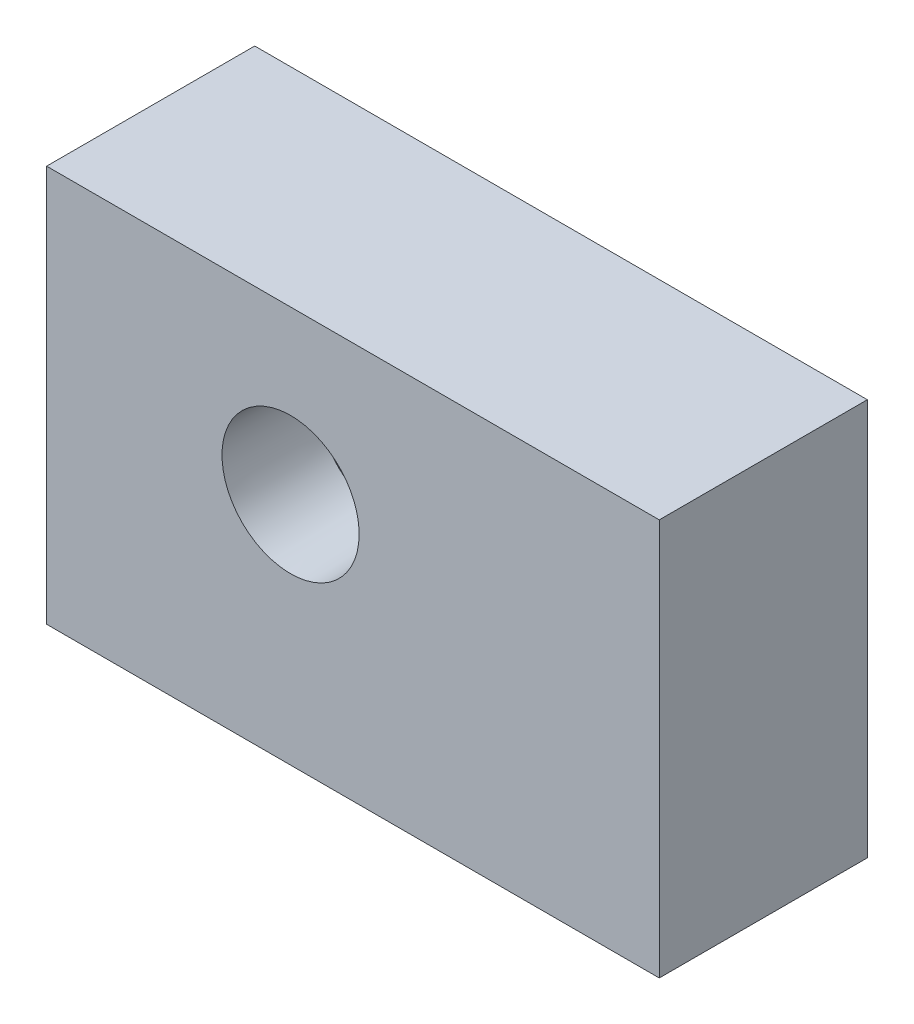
from build123d import *

# Parameters (mm, degrees)
SKIZZE1_W               = 88.320309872
SKIZZE1_H               = 57.199415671
LINEAR_AUSTRAGEN1_DEPTH = 30


with BuildPart() as part:
    # Skizze1 → Linear austragen1 (new body)
    with BuildSketch(Plane.XY):
        with Locations((44.160154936, 28.599707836)):
            Rectangle(SKIZZE1_W, SKIZZE1_H)
    extrude(amount=LINEAR_AUSTRAGEN1_DEPTH)

    # Skizze2 → 1_2 NPT Gewindebohrung1 (revolve, cut)
    with BuildSketch(Plane(origin=(35.167512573, 33.781279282, 30), x_dir=(0, -1, 0), z_dir=(1, 0, 0))):
        Polygon((0, 0), (0, 28.003543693), (8.9281, 22.639), (8.9281, 13.5712), (9.479721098, 13.5712), (9.886061, 0), align=None)
    revolve(axis=Axis((35.167512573, 33.781279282, 36.35), (0, 0, -1)), mode=Mode.SUBTRACT)


solid = part.part
